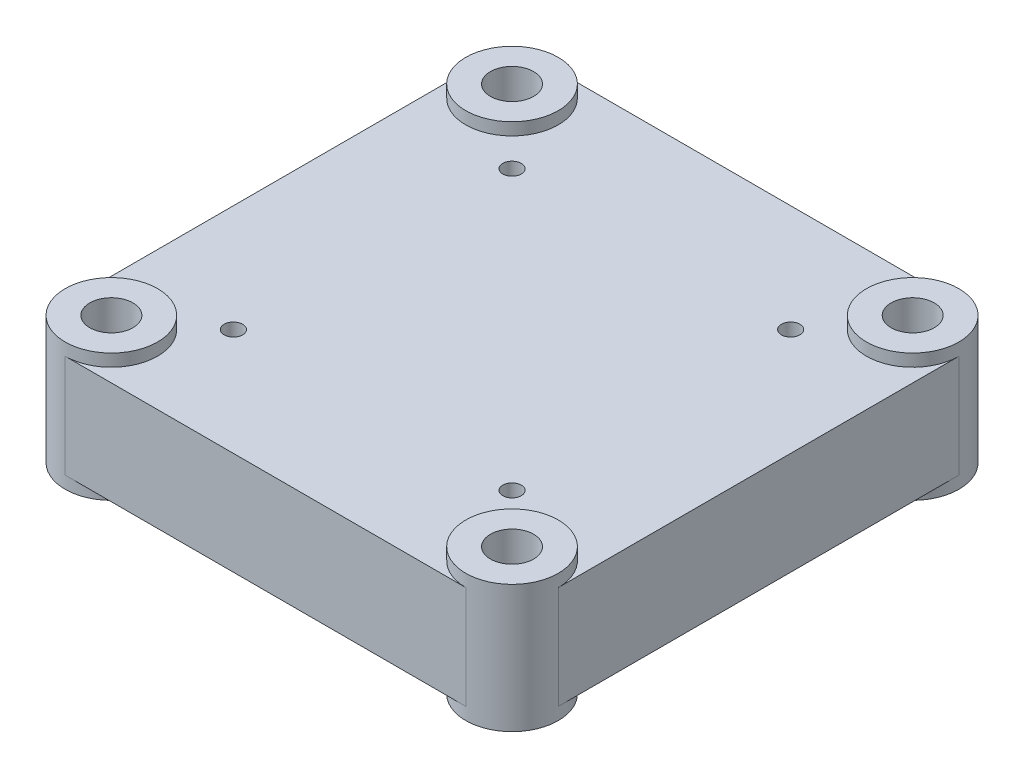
from build123d import *
from build123d.topology import SkipClean

# Parameters (mm, degrees)
SKETCH1_R           = 3.5
SKETCH1_R_2         = 1.5
BOSS_EXTRUDE1_DEPTH = 16.7
SKETCH4_R           = 7.5
SKETCH4_R_2         = 3.5
BOSS_EXTRUDE5_DEPTH = 2
SKETCH5_R           = 17.4
BOSS_EXTRUDE7_DEPTH = 8
BOSS_EXTRUDE8_START = -18.7
SKETCH4_2_R         = 7.5
SKETCH4_2_R_2       = 3.5
BOSS_EXTRUDE8_DEPTH = 2


with BuildPart() as part:
    # Sketch1 → Boss-Extrude1 (new body)
    with BuildSketch(Plane(origin=(0, 0, 0), x_dir=(1, 0, 0), z_dir=(0, 1, 0))):
        with BuildLine():
            Line((-32.5, -40), (32.5, -40))
            ThreePointArc((32.5, -40), (37.803300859, -37.803300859), (40, -32.5))
            Line((40, -32.5), (40, 32.5))
            ThreePointArc((40, 32.5), (37.803300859, 37.803300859), (32.5, 40))
            Line((32.5, 40), (-32.5, 40))
            ThreePointArc((-32.5, 40), (-37.803300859, 37.803300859), (-40, 32.5))
            Line((-40, 32.5), (-40, -32.5))
            ThreePointArc((-40, -32.5), (-37.803300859, -37.803300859), (-32.5, -40))
        make_face()
        with Locations(Location((32.5, 32.5, 0), (0, 0, 270))):
            Circle(SKETCH1_R, mode=Mode.SUBTRACT)
        with Locations(Location((-32.5, -32.5, 0), (0, 0, 90))):
            Circle(SKETCH1_R, mode=Mode.SUBTRACT)
        with Locations(Location((-32.5, 32.5, 0), (0, 0, 90))):
            Circle(SKETCH1_R, mode=Mode.SUBTRACT)
        with Locations(Location((32.5, -32.5, 0), (0, 0, 270))):
            Circle(SKETCH1_R, mode=Mode.SUBTRACT)
        with Locations(Location((22.600505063, -22.600505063, 0), (0, 0, 270))):
            Circle(SKETCH1_R_2, mode=Mode.SUBTRACT)
        with Locations(Location((-22.600505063, -22.600505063, 0), (0, 0, 90))):
            Circle(SKETCH1_R_2, mode=Mode.SUBTRACT)
        with Locations(Location((-22.600505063, 22.600505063, 0), (0, 0, 270))):
            Circle(SKETCH1_R_2, mode=Mode.SUBTRACT)
        with Locations(Location((22.600505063, 22.600505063, 0), (0, 0, 90))):
            Circle(SKETCH1_R_2, mode=Mode.SUBTRACT)
    extrude(amount=BOSS_EXTRUDE1_DEPTH)

    # Sketch4 → Boss-Extrude5 (add)
    # profile 1 of 4: a face of its own
    with BuildSketch(Plane(origin=(0, 16.7, 0), x_dir=(1, 0, 0), z_dir=(0, 1, 0))):
        with Locations(Location((32.5, 32.5, 0), (0, 0, 90))):
            Circle(SKETCH4_R)
        with Locations(Location((32.5, 32.5, 0), (0, 0, 90))):
            Circle(SKETCH4_R_2, mode=Mode.SUBTRACT)
    # profile 2 of 4: a face of its own
    with BuildSketch(Plane(origin=(0, 16.7, 0), x_dir=(1, 0, 0), z_dir=(0, 1, 0))):
        with Locations(Location((32.5, -32.5, 0), (0, 0, 90))):
            Circle(SKETCH4_R)
        with Locations(Location((32.5, -32.5, 0), (0, 0, 90))):
            Circle(SKETCH4_R_2, mode=Mode.SUBTRACT)
    # profile 3 of 4: a face of its own
    with BuildSketch(Plane(origin=(0, 16.7, 0), x_dir=(1, 0, 0), z_dir=(0, 1, 0))):
        with Locations(Location((-32.5, -32.5, 0), (0, 0, 90))):
            Circle(SKETCH4_R)
        with Locations(Location((-32.5, -32.5, 0), (0, 0, 90))):
            Circle(SKETCH4_R_2, mode=Mode.SUBTRACT)
    # profile 4 of 4: a face of its own
    with BuildSketch(Plane(origin=(0, 16.7, 0), x_dir=(1, 0, 0), z_dir=(0, 1, 0))):
        with Locations(Location((-32.5, 32.5, 0), (0, 0, 90))):
            Circle(SKETCH4_R)
        with Locations(Location((-32.5, 32.5, 0), (0, 0, 90))):
            Circle(SKETCH4_R_2, mode=Mode.SUBTRACT)
    extrude(amount=BOSS_EXTRUDE5_DEPTH)

    # Sketch5 → Boss-Extrude7 (add)
    with BuildSketch(Plane.XZ):
        with Locations(Location((0, 0, 0), (0, 0, 270))):
            Circle(SKETCH5_R)
    extrude(amount=BOSS_EXTRUDE7_DEPTH)

    # Sketch4_2 → Boss-Extrude8 (add)
    # profile 1 of 4: a face of its own
    with SkipClean():  # the faces are left unmerged after this step: merging them gives an invalid solid
        with BuildSketch(Plane(origin=(0, 16.7, 0), x_dir=(1, 0, 0), z_dir=(0, 1, 0)).offset(BOSS_EXTRUDE8_START)):
            with Locations(Location((32.5, 32.5, 0), (0, 0, 90))):
                Circle(SKETCH4_2_R)
            with Locations(Location((32.5, 32.5, 0), (0, 0, 90))):
                Circle(SKETCH4_2_R_2, mode=Mode.SUBTRACT)
        # profile 2 of 4: a face of its own
        with BuildSketch(Plane(origin=(0, 16.7, 0), x_dir=(1, 0, 0), z_dir=(0, 1, 0)).offset(BOSS_EXTRUDE8_START)):
            with Locations(Location((32.5, -32.5, 0), (0, 0, 90))):
                Circle(SKETCH4_2_R)
            with Locations(Location((32.5, -32.5, 0), (0, 0, 90))):
                Circle(SKETCH4_2_R_2, mode=Mode.SUBTRACT)
        # profile 3 of 4: a face of its own
        with BuildSketch(Plane(origin=(0, 16.7, 0), x_dir=(1, 0, 0), z_dir=(0, 1, 0)).offset(BOSS_EXTRUDE8_START)):
            with Locations(Location((-32.5, -32.5, 0), (0, 0, 90))):
                Circle(SKETCH4_2_R)
            with Locations(Location((-32.5, -32.5, 0), (0, 0, 90))):
                Circle(SKETCH4_2_R_2, mode=Mode.SUBTRACT)
        # profile 4 of 4: a face of its own
        with BuildSketch(Plane(origin=(0, 16.7, 0), x_dir=(1, 0, 0), z_dir=(0, 1, 0)).offset(BOSS_EXTRUDE8_START)):
            with Locations(Location((-32.5, 32.5, 0), (0, 0, 90))):
                Circle(SKETCH4_2_R)
            with Locations(Location((-32.5, 32.5, 0), (0, 0, 90))):
                Circle(SKETCH4_2_R_2, mode=Mode.SUBTRACT)
        extrude(amount=BOSS_EXTRUDE8_DEPTH)


solid = part.part
